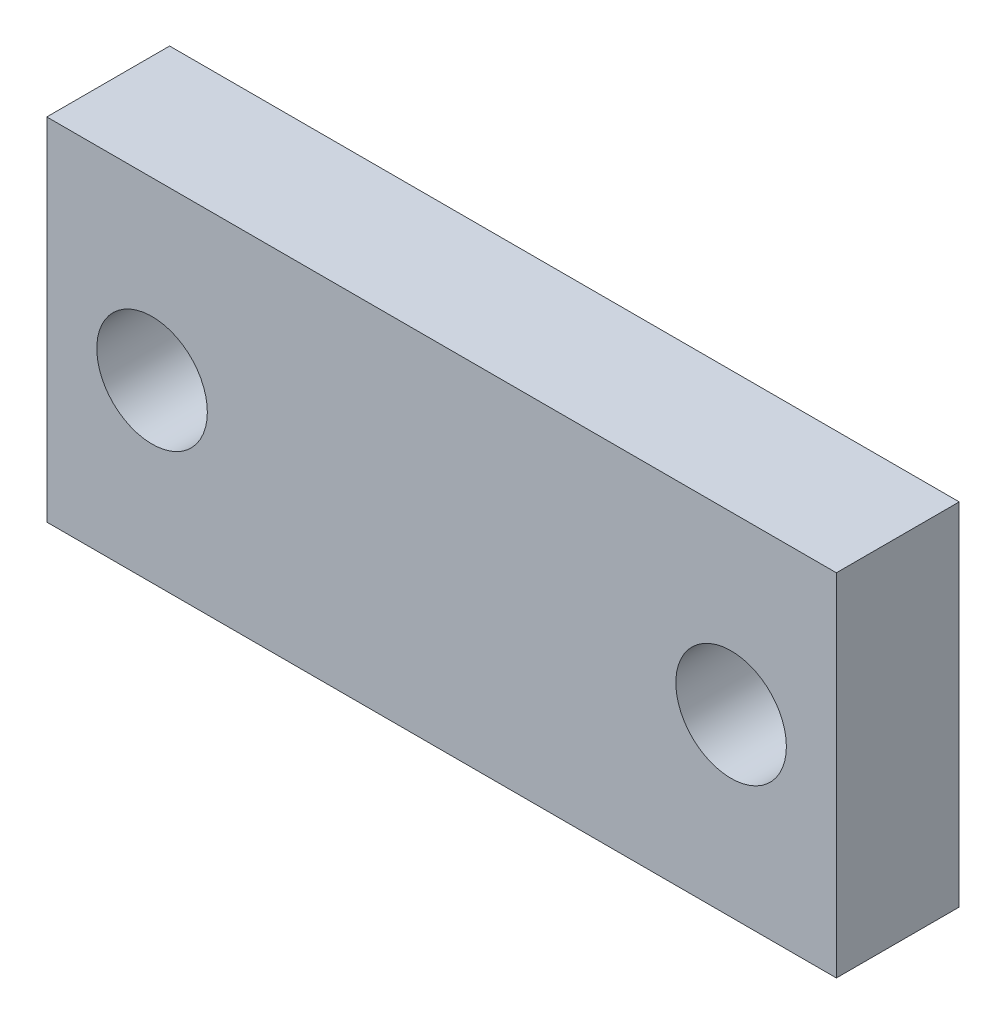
ISO-10303-21;
HEADER;
FILE_DESCRIPTION(('STEP AP214'),'2;1');
FILE_NAME('part.step','',(''),(''),'','','');
FILE_SCHEMA(('AUTOMOTIVE_DESIGN { 1 0 10303 214 1 1 1 1 }'));
ENDSEC;
DATA;
#1=APPLICATION_CONTEXT('core data for automotive mechanical design processes');
#2=APPLICATION_PROTOCOL_DEFINITION('international standard','automotive_design',2000,#1);
#3=PRODUCT_CONTEXT('',#1,'mechanical');
#4=PRODUCT('Part','Part','',(#3));
#5=PRODUCT_RELATED_PRODUCT_CATEGORY('part','',(#4));
#6=PRODUCT_DEFINITION_FORMATION('','',#4);
#7=PRODUCT_DEFINITION_CONTEXT('part definition',#1,'design');
#8=PRODUCT_DEFINITION('design','',#6,#7);
#9=PRODUCT_DEFINITION_SHAPE('','',#8);
#10=(LENGTH_UNIT() NAMED_UNIT(*) SI_UNIT(.MILLI.,.METRE.));
#11=(NAMED_UNIT(*) PLANE_ANGLE_UNIT() SI_UNIT($,.RADIAN.));
#12=(NAMED_UNIT(*) SI_UNIT($,.STERADIAN.) SOLID_ANGLE_UNIT());
#13=UNCERTAINTY_MEASURE_WITH_UNIT(LENGTH_MEASURE(1.E-05),#10,'distance_accuracy_value','');
#14=(GEOMETRIC_REPRESENTATION_CONTEXT(3) GLOBAL_UNCERTAINTY_ASSIGNED_CONTEXT((#13)) GLOBAL_UNIT_ASSIGNED_CONTEXT((#10,
#11,#12)) REPRESENTATION_CONTEXT('',''));
#15=CARTESIAN_POINT('',(0.,0.,0.));
#16=DIRECTION('',(0.,0.,1.));
#17=DIRECTION('',(1.,0.,0.));
#18=AXIS2_PLACEMENT_3D('',#15,#16,#17);
#19=CARTESIAN_POINT('',(0.,0.,7.));
#20=DIRECTION('',(1.,0.,0.));
#21=DIRECTION('',(0.,1.,0.));
#22=AXIS2_PLACEMENT_3D('',#19,#20,#21);
#23=PLANE('',#22);
#24=DIRECTION('',(0.,-1.,0.));
#25=VECTOR('',#24,1.);
#26=CARTESIAN_POINT('',(0.,0.,0.));
#27=LINE('',#26,#25);
#28=CARTESIAN_POINT('',(0.,0.,0.));
#29=VERTEX_POINT('',#28);
#30=CARTESIAN_POINT('',(0.,-20.,0.));
#31=VERTEX_POINT('',#30);
#32=EDGE_CURVE('E96',#29,#31,#27,.T.);
#33=ORIENTED_EDGE('',*,*,#32,.T.);
#34=DIRECTION('',(0.,0.,-1.));
#35=VECTOR('',#34,1.);
#36=CARTESIAN_POINT('',(0.,-20.,7.));
#37=LINE('',#36,#35);
#38=CARTESIAN_POINT('',(0.,-20.,7.));
#39=VERTEX_POINT('',#38);
#40=EDGE_CURVE('E11',#39,#31,#37,.T.);
#41=ORIENTED_EDGE('',*,*,#40,.F.);
#42=DIRECTION('',(0.,-1.,0.));
#43=VECTOR('',#42,1.);
#44=CARTESIAN_POINT('',(0.,0.,7.));
#45=LINE('',#44,#43);
#46=CARTESIAN_POINT('',(0.,0.,7.));
#47=VERTEX_POINT('',#46);
#48=EDGE_CURVE('E84',#47,#39,#45,.T.);
#49=ORIENTED_EDGE('',*,*,#48,.F.);
#50=DIRECTION('',(0.,0.,-1.));
#51=VECTOR('',#50,1.);
#52=CARTESIAN_POINT('',(0.,0.,7.));
#53=LINE('',#52,#51);
#54=EDGE_CURVE('E92',#47,#29,#53,.T.);
#55=ORIENTED_EDGE('',*,*,#54,.T.);
#56=EDGE_LOOP('',(#33,#41,#49,#55));
#57=FACE_BOUND('',#56,.T.);
#58=ADVANCED_FACE('F33',(#57),#23,.F.);
#59=CARTESIAN_POINT('',(0.,-20.,7.));
#60=DIRECTION('',(0.,1.,0.));
#61=DIRECTION('',(0.,0.,1.));
#62=AXIS2_PLACEMENT_3D('',#59,#60,#61);
#63=PLANE('',#62);
#64=DIRECTION('',(1.,0.,0.));
#65=VECTOR('',#64,1.);
#66=CARTESIAN_POINT('',(0.,-20.,0.));
#67=LINE('',#66,#65);
#68=CARTESIAN_POINT('',(45.,-20.,0.));
#69=VERTEX_POINT('',#68);
#70=EDGE_CURVE('E88',#31,#69,#67,.T.);
#71=ORIENTED_EDGE('',*,*,#70,.T.);
#72=DIRECTION('',(0.,0.,-1.));
#73=VECTOR('',#72,1.);
#74=CARTESIAN_POINT('',(45.,-20.,7.));
#75=LINE('',#74,#73);
#76=CARTESIAN_POINT('',(45.,-20.,7.));
#77=VERTEX_POINT('',#76);
#78=EDGE_CURVE('E41',#77,#69,#75,.T.);
#79=ORIENTED_EDGE('',*,*,#78,.F.);
#80=DIRECTION('',(1.,0.,0.));
#81=VECTOR('',#80,1.);
#82=CARTESIAN_POINT('',(0.,-20.,7.));
#83=LINE('',#82,#81);
#84=EDGE_CURVE('E79',#39,#77,#83,.T.);
#85=ORIENTED_EDGE('',*,*,#84,.F.);
#86=ORIENTED_EDGE('',*,*,#40,.T.);
#87=EDGE_LOOP('',(#71,#79,#85,#86));
#88=FACE_BOUND('',#87,.T.);
#89=ADVANCED_FACE('F87',(#88),#63,.F.);
#90=CARTESIAN_POINT('',(45.,0.,7.));
#91=DIRECTION('',(-1.,0.,0.));
#92=DIRECTION('',(0.,-1.,0.));
#93=AXIS2_PLACEMENT_3D('',#90,#91,#92);
#94=PLANE('',#93);
#95=DIRECTION('',(0.,1.,0.));
#96=VECTOR('',#95,1.);
#97=CARTESIAN_POINT('',(45.,0.,0.));
#98=LINE('',#97,#96);
#99=CARTESIAN_POINT('',(45.,0.,0.));
#100=VERTEX_POINT('',#99);
#101=EDGE_CURVE('E66',#69,#100,#98,.T.);
#102=ORIENTED_EDGE('',*,*,#101,.T.);
#103=DIRECTION('',(0.,0.,-1.));
#104=VECTOR('',#103,1.);
#105=CARTESIAN_POINT('',(45.,0.,7.));
#106=LINE('',#105,#104);
#107=CARTESIAN_POINT('',(45.,0.,7.));
#108=VERTEX_POINT('',#107);
#109=EDGE_CURVE('E89',#108,#100,#106,.T.);
#110=ORIENTED_EDGE('',*,*,#109,.F.);
#111=DIRECTION('',(0.,1.,0.));
#112=VECTOR('',#111,1.);
#113=CARTESIAN_POINT('',(45.,0.,7.));
#114=LINE('',#113,#112);
#115=EDGE_CURVE('E82',#77,#108,#114,.T.);
#116=ORIENTED_EDGE('',*,*,#115,.F.);
#117=ORIENTED_EDGE('',*,*,#78,.T.);
#118=EDGE_LOOP('',(#102,#110,#116,#117));
#119=FACE_BOUND('',#118,.T.);
#120=ADVANCED_FACE('F90',(#119),#94,.F.);
#121=CARTESIAN_POINT('',(0.,0.,7.));
#122=DIRECTION('',(0.,-1.,0.));
#123=DIRECTION('',(0.,0.,-1.));
#124=AXIS2_PLACEMENT_3D('',#121,#122,#123);
#125=PLANE('',#124);
#126=DIRECTION('',(-1.,0.,0.));
#127=VECTOR('',#126,1.);
#128=CARTESIAN_POINT('',(0.,0.,0.));
#129=LINE('',#128,#127);
#130=EDGE_CURVE('E72',#100,#29,#129,.T.);
#131=ORIENTED_EDGE('',*,*,#130,.T.);
#132=ORIENTED_EDGE('',*,*,#54,.F.);
#133=DIRECTION('',(-1.,0.,0.));
#134=VECTOR('',#133,1.);
#135=CARTESIAN_POINT('',(0.,0.,7.));
#136=LINE('',#135,#134);
#137=EDGE_CURVE('E49',#108,#47,#136,.T.);
#138=ORIENTED_EDGE('',*,*,#137,.F.);
#139=ORIENTED_EDGE('',*,*,#109,.T.);
#140=EDGE_LOOP('',(#131,#132,#138,#139));
#141=FACE_BOUND('',#140,.T.);
#142=ADVANCED_FACE('F104',(#141),#125,.F.);
#143=CARTESIAN_POINT('',(0.,0.,7.));
#144=DIRECTION('',(0.,0.,1.));
#145=DIRECTION('',(1.,0.,0.));
#146=AXIS2_PLACEMENT_3D('',#143,#144,#145);
#147=PLANE('',#146);
#148=CARTESIAN_POINT('',(6.,-10.,7.));
#149=DIRECTION('',(0.,0.,1.));
#150=DIRECTION('',(1.,0.,0.));
#151=AXIS2_PLACEMENT_3D('',#148,#149,#150);
#152=CIRCLE('',#151,3.15);
#153=CARTESIAN_POINT('',(9.15,-10.,7.));
#154=VERTEX_POINT('',#153);
#155=EDGE_CURVE('E116',#154,#154,#152,.T.);
#156=ORIENTED_EDGE('',*,*,#155,.F.);
#157=EDGE_LOOP('',(#156));
#158=FACE_BOUND('',#157,.T.);
#159=CARTESIAN_POINT('',(39.,-10.,7.));
#160=DIRECTION('',(0.,0.,1.));
#161=DIRECTION('',(1.,0.,0.));
#162=AXIS2_PLACEMENT_3D('',#159,#160,#161);
#163=CIRCLE('',#162,3.15);
#164=CARTESIAN_POINT('',(42.15,-10.,7.));
#165=VERTEX_POINT('',#164);
#166=EDGE_CURVE('E110',#165,#165,#163,.T.);
#167=ORIENTED_EDGE('',*,*,#166,.F.);
#168=EDGE_LOOP('',(#167));
#169=FACE_BOUND('',#168,.T.);
#170=ORIENTED_EDGE('',*,*,#48,.T.);
#171=ORIENTED_EDGE('',*,*,#84,.T.);
#172=ORIENTED_EDGE('',*,*,#115,.T.);
#173=ORIENTED_EDGE('',*,*,#137,.T.);
#174=EDGE_LOOP('',(#170,#171,#172,#173));
#175=FACE_BOUND('',#174,.T.);
#176=ADVANCED_FACE('F80',(#158,#169,#175),#147,.T.);
#177=CARTESIAN_POINT('',(0.,0.,0.));
#178=DIRECTION('',(0.,0.,1.));
#179=DIRECTION('',(1.,0.,0.));
#180=AXIS2_PLACEMENT_3D('',#177,#178,#179);
#181=PLANE('',#180);
#182=CARTESIAN_POINT('',(6.,-10.,0.));
#183=DIRECTION('',(0.,0.,1.));
#184=DIRECTION('',(1.,0.,0.));
#185=AXIS2_PLACEMENT_3D('',#182,#183,#184);
#186=CIRCLE('',#185,3.15);
#187=CARTESIAN_POINT('',(9.15,-10.,0.));
#188=VERTEX_POINT('',#187);
#189=EDGE_CURVE('E99',#188,#188,#186,.T.);
#190=ORIENTED_EDGE('',*,*,#189,.T.);
#191=EDGE_LOOP('',(#190));
#192=FACE_BOUND('',#191,.T.);
#193=CARTESIAN_POINT('',(39.,-10.,0.));
#194=DIRECTION('',(0.,0.,1.));
#195=DIRECTION('',(1.,0.,0.));
#196=AXIS2_PLACEMENT_3D('',#193,#194,#195);
#197=CIRCLE('',#196,3.15);
#198=CARTESIAN_POINT('',(42.15,-10.,0.));
#199=VERTEX_POINT('',#198);
#200=EDGE_CURVE('E113',#199,#199,#197,.T.);
#201=ORIENTED_EDGE('',*,*,#200,.T.);
#202=EDGE_LOOP('',(#201));
#203=FACE_BOUND('',#202,.T.);
#204=ORIENTED_EDGE('',*,*,#32,.F.);
#205=ORIENTED_EDGE('',*,*,#130,.F.);
#206=ORIENTED_EDGE('',*,*,#101,.F.);
#207=ORIENTED_EDGE('',*,*,#70,.F.);
#208=EDGE_LOOP('',(#204,#205,#206,#207));
#209=FACE_BOUND('',#208,.T.);
#210=ADVANCED_FACE('F107',(#192,#203,#209),#181,.F.);
#211=CARTESIAN_POINT('',(39.,-10.,0.));
#212=DIRECTION('',(0.,0.,1.));
#213=DIRECTION('',(1.,0.,0.));
#214=AXIS2_PLACEMENT_3D('',#211,#212,#213);
#215=CYLINDRICAL_SURFACE('',#214,3.15);
#216=ORIENTED_EDGE('',*,*,#200,.F.);
#217=EDGE_LOOP('',(#216));
#218=FACE_BOUND('',#217,.T.);
#219=ORIENTED_EDGE('',*,*,#166,.T.);
#220=EDGE_LOOP('',(#219));
#221=FACE_BOUND('',#220,.T.);
#222=ADVANCED_FACE('F127',(#218,#221),#215,.F.);
#223=CARTESIAN_POINT('',(6.,-10.,0.));
#224=DIRECTION('',(0.,0.,1.));
#225=DIRECTION('',(1.,0.,0.));
#226=AXIS2_PLACEMENT_3D('',#223,#224,#225);
#227=CYLINDRICAL_SURFACE('',#226,3.15);
#228=ORIENTED_EDGE('',*,*,#189,.F.);
#229=EDGE_LOOP('',(#228));
#230=FACE_BOUND('',#229,.T.);
#231=ORIENTED_EDGE('',*,*,#155,.T.);
#232=EDGE_LOOP('',(#231));
#233=FACE_BOUND('',#232,.T.);
#234=ADVANCED_FACE('F124',(#230,#233),#227,.F.);
#235=CLOSED_SHELL('',(#58,#89,#120,#142,#176,#210,#222,#234));
#236=MANIFOLD_SOLID_BREP('B2',#235);
#237=ADVANCED_BREP_SHAPE_REPRESENTATION('',(#18,#236),#14);
#238=SHAPE_DEFINITION_REPRESENTATION(#9,#237);
ENDSEC;
END-ISO-10303-21;
